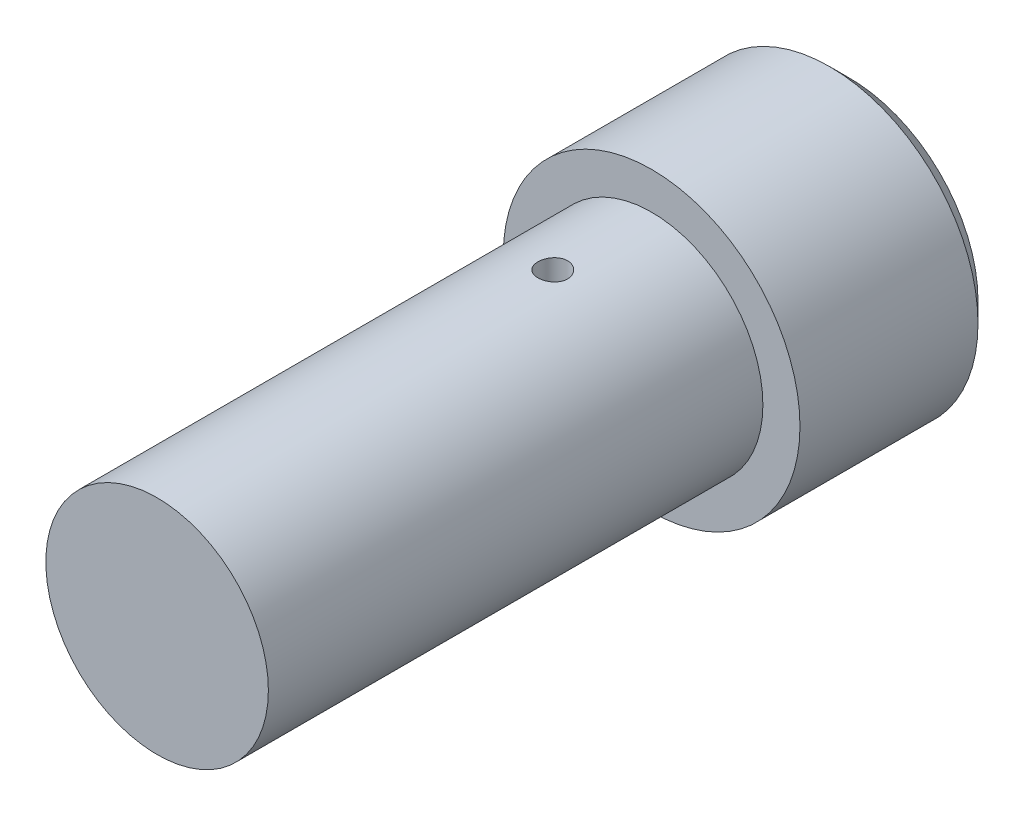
from build123d import *

# Parameters (mm, degrees)
ESQUISSE1_R             = 30
BASE_EXTRUSION_DEPTH    = 40
ESQUISSE2_R             = 22.5
BOSS_EXTRU_1_DEPTH      = 100
ESQUISSE3_R             = 3
ENL_V_MAT_EXTRU_1_DEPTH = 30
CHANFREIN1_SIZE         = 4


with BuildPart() as part:
    # Esquisse1 → Base-Extrusion (new body)
    with BuildSketch(Plane.XY):
        Circle(ESQUISSE1_R)
    extrude(amount=BASE_EXTRUSION_DEPTH)

    # Esquisse2 → Boss.-Extru.1 (add)
    with BuildSketch(Plane.XY.offset(40)):
        Circle(ESQUISSE2_R)
    extrude(amount=BOSS_EXTRU_1_DEPTH)

    # Esquisse3 → Enl_v. mat.-Extru.1 (cut)
    with BuildSketch(Plane(origin=(0, 30, 0), x_dir=(-1, 0, 0), z_dir=(0, 1, 0))):
        with Locations(Location((0, 60, 0), (0, 0, 90))):
            Circle(ESQUISSE3_R)
    extrude(amount=-ENL_V_MAT_EXTRU_1_DEPTH, mode=Mode.SUBTRACT)

    # Chanfrein1
    chanfrein1_edges = [part.edges().sort_by_distance(p)[0] for p in [
        (-30, 0, 0),
    ]]
    chamfer(chanfrein1_edges, length=CHANFREIN1_SIZE)


solid = part.part
